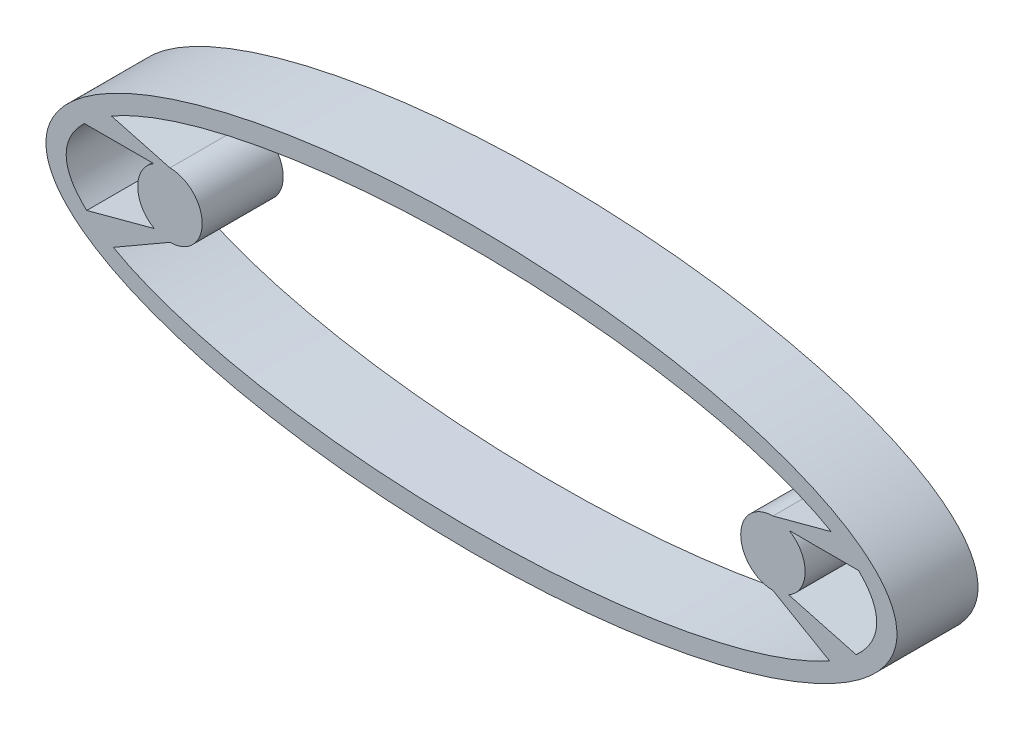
from build123d import *

# Parameters (mm, degrees)
BOSS_EXTRUDE1_DEPTH = 10


with BuildPart() as part:
    # Sketch3 → Boss-Extrude1 (new body)
    with BuildSketch(Plane.XY):
        with BuildLine():
            add(Edge.make_bspline(
                [(52.5, 0), (52.5, 30.310889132), (-26.25, 15.155444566), (-105, 0), (-26.25, -15.155444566), (52.5, -30.310889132), (52.5, 0)],
                knots=[0, 0, 0, 2.094395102, 2.094395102, 4.188790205, 4.188790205, 6.283185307, 6.283185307, 6.283185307], degree=2, weights=[1, 0.5, 1, 0.5, 1, 0.5, 1]))
        make_face()
        with BuildLine():
            Line((-39.133691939, -2.484157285), (-47.464190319, -4.716307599))
            add(Edge.make_bspline(
                [(-47.774154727, 4.425687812), (-52.494431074, -0.160186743), (-47.464190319, -4.716307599)],
                knots=[2.842089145, 2.842089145, 2.842089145, 3.461438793, 3.461438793, 3.461438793], degree=2, weights=[1, 0.952432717, 1]))
            Line((-47.774154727, 4.425687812), (-39.197974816, 4.425687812))
            ThreePointArc((-39.197974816, 4.425687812), (-41.174022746, 0.952082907), (-39.133691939, -2.484157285))
        make_face(mode=Mode.SUBTRACT)
        with BuildLine():
            ThreePointArc((39.133691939, -2.484157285), (41.174022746, 0.952082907), (39.197974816, 4.425687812))
            Line((39.197974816, 4.425687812), (47.774154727, 4.425687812))
            add(Edge.make_bspline(
                [(47.464190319, -4.716307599), (52.494431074, -0.160186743), (47.774154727, 4.425687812)],
                knots=[2.821746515, 2.821746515, 2.821746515, 3.441096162, 3.441096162, 3.441096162], degree=2, weights=[1, 0.952432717, 1]))
            Line((47.464190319, -4.716307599), (39.133691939, -2.484157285))
        make_face(mode=Mode.SUBTRACT)
        with BuildLine():
            Line((-44.184735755, -7.020955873), (-37.197974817, -2.987147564))
            ThreePointArc((-37.197974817, -2.987147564), (-33.221754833, 0.989072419), (-37.197974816, 4.965292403))
            Line((-37.197974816, 4.965292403), (-44.403047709, 6.895885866))
            add(Edge.make_bspline(
                [(44.403047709, 6.895885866), (0, 32.62815023), (-44.403047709, 6.895885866)],
                knots=[0.477686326, 0.477686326, 0.477686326, 2.663906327, 2.663906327, 2.663906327], degree=2, weights=[1, 0.459725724, 1]))
            Line((44.403047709, 6.895885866), (37.197974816, 4.965292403))
            ThreePointArc((37.197974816, 4.965292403), (33.221754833, 0.989072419), (37.197974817, -2.987147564))
            Line((37.197974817, -2.987147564), (44.184735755, -7.020955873))
            add(Edge.make_bspline(
                [(0, -15), (30.097287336, -15), (44.184735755, -7.020955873)],
                knots=[4.71238898, 4.71238898, 4.71238898, 5.796086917, 5.796086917, 5.796086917], degree=2, weights=[0.734031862, 0.734031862, 1]))
            add(Edge.make_bspline(
                [(-44.184735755, -7.020955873), (-30.097287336, -15), (0, -15)],
                knots=[3.628691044, 3.628691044, 3.628691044, 4.71238898, 4.71238898, 4.71238898], degree=2, weights=[1, 0.734031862, 0.734031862]))
        make_face(mode=Mode.SUBTRACT)
    extrude(amount=BOSS_EXTRUDE1_DEPTH)


solid = part.part
